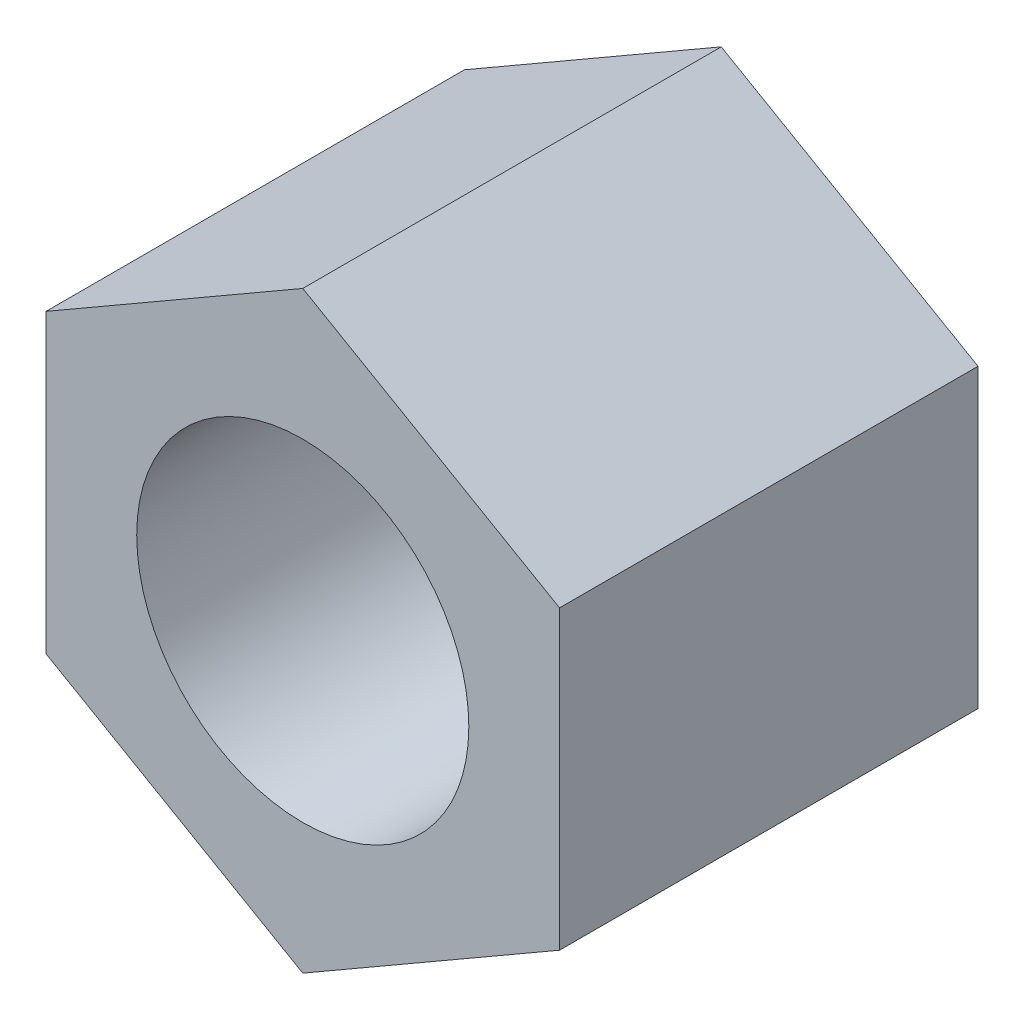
ISO-10303-21;
HEADER;
FILE_DESCRIPTION(('STEP AP214'),'2;1');
FILE_NAME('part.step','',(''),(''),'','','');
FILE_SCHEMA(('AUTOMOTIVE_DESIGN { 1 0 10303 214 1 1 1 1 }'));
ENDSEC;
DATA;
#1=APPLICATION_CONTEXT('core data for automotive mechanical design processes');
#2=APPLICATION_PROTOCOL_DEFINITION('international standard','automotive_design',2000,#1);
#3=PRODUCT_CONTEXT('',#1,'mechanical');
#4=PRODUCT('Part','Part','',(#3));
#5=PRODUCT_RELATED_PRODUCT_CATEGORY('part','',(#4));
#6=PRODUCT_DEFINITION_FORMATION('','',#4);
#7=PRODUCT_DEFINITION_CONTEXT('part definition',#1,'design');
#8=PRODUCT_DEFINITION('design','',#6,#7);
#9=PRODUCT_DEFINITION_SHAPE('','',#8);
#10=(LENGTH_UNIT() NAMED_UNIT(*) SI_UNIT(.MILLI.,.METRE.));
#11=(NAMED_UNIT(*) PLANE_ANGLE_UNIT() SI_UNIT($,.RADIAN.));
#12=(NAMED_UNIT(*) SI_UNIT($,.STERADIAN.) SOLID_ANGLE_UNIT());
#13=UNCERTAINTY_MEASURE_WITH_UNIT(LENGTH_MEASURE(1.E-05),#10,'distance_accuracy_value','');
#14=(GEOMETRIC_REPRESENTATION_CONTEXT(3) GLOBAL_UNCERTAINTY_ASSIGNED_CONTEXT((#13)) GLOBAL_UNIT_ASSIGNED_CONTEXT((#10,
#11,#12)) REPRESENTATION_CONTEXT('',''));
#15=CARTESIAN_POINT('',(0.,0.,0.));
#16=DIRECTION('',(0.,0.,1.));
#17=DIRECTION('',(1.,0.,0.));
#18=AXIS2_PLACEMENT_3D('',#15,#16,#17);
#19=CARTESIAN_POINT('',(0.,0.,56.007));
#20=DIRECTION('',(0.,0.,1.));
#21=DIRECTION('',(1.,0.,0.));
#22=AXIS2_PLACEMENT_3D('',#19,#20,#21);
#23=PLANE('',#22);
#24=DIRECTION('',(0.,1.,0.));
#25=VECTOR('',#24,1.);
#26=CARTESIAN_POINT('',(34.3662,-19.8413348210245,56.007));
#27=LINE('',#26,#25);
#28=CARTESIAN_POINT('',(34.3662,-19.8413348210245,56.007));
#29=VERTEX_POINT('',#28);
#30=CARTESIAN_POINT('',(34.3662,19.8413348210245,56.007));
#31=VERTEX_POINT('',#30);
#32=EDGE_CURVE('E139',#29,#31,#27,.T.);
#33=ORIENTED_EDGE('',*,*,#32,.T.);
#34=DIRECTION('',(-0.866025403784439,0.5,0.));
#35=VECTOR('',#34,1.);
#36=CARTESIAN_POINT('',(34.3662,19.8413348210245,56.007));
#37=LINE('',#36,#35);
#38=CARTESIAN_POINT('',(0.,39.682669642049,56.007));
#39=VERTEX_POINT('',#38);
#40=EDGE_CURVE('E100',#31,#39,#37,.T.);
#41=ORIENTED_EDGE('',*,*,#40,.T.);
#42=DIRECTION('',(-0.866025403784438,-0.5,0.));
#43=VECTOR('',#42,1.);
#44=CARTESIAN_POINT('',(0.,39.682669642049,56.007));
#45=LINE('',#44,#43);
#46=CARTESIAN_POINT('',(-34.3662,19.8413348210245,56.007));
#47=VERTEX_POINT('',#46);
#48=EDGE_CURVE('E109',#39,#47,#45,.T.);
#49=ORIENTED_EDGE('',*,*,#48,.T.);
#50=DIRECTION('',(0.,-1.,0.));
#51=VECTOR('',#50,1.);
#52=CARTESIAN_POINT('',(-34.3662,19.8413348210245,56.007));
#53=LINE('',#52,#51);
#54=CARTESIAN_POINT('',(-34.3662,-19.8413348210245,56.007));
#55=VERTEX_POINT('',#54);
#56=EDGE_CURVE('E102',#47,#55,#53,.T.);
#57=ORIENTED_EDGE('',*,*,#56,.T.);
#58=DIRECTION('',(0.866025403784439,-0.5,0.));
#59=VECTOR('',#58,1.);
#60=CARTESIAN_POINT('',(-34.3662,-19.8413348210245,56.007));
#61=LINE('',#60,#59);
#62=CARTESIAN_POINT('',(0.,-39.682669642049,56.007));
#63=VERTEX_POINT('',#62);
#64=EDGE_CURVE('E107',#55,#63,#61,.T.);
#65=ORIENTED_EDGE('',*,*,#64,.T.);
#66=DIRECTION('',(0.866025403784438,0.5,0.));
#67=VECTOR('',#66,1.);
#68=CARTESIAN_POINT('',(0.,-39.682669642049,56.007));
#69=LINE('',#68,#67);
#70=EDGE_CURVE('E58',#63,#29,#69,.T.);
#71=ORIENTED_EDGE('',*,*,#70,.T.);
#72=EDGE_LOOP('',(#33,#41,#49,#57,#65,#71));
#73=FACE_BOUND('',#72,.T.);
#74=CARTESIAN_POINT('',(0.,0.,56.007));
#75=DIRECTION('',(0.,0.,1.));
#76=DIRECTION('',(1.,0.,0.));
#77=AXIS2_PLACEMENT_3D('',#74,#75,#76);
#78=CIRCLE('',#77,22.225);
#79=CARTESIAN_POINT('',(22.225,0.,56.007));
#80=VERTEX_POINT('',#79);
#81=EDGE_CURVE('E135',#80,#80,#78,.T.);
#82=ORIENTED_EDGE('',*,*,#81,.F.);
#83=EDGE_LOOP('',(#82));
#84=FACE_BOUND('',#83,.T.);
#85=ADVANCED_FACE('F43',(#73,#84),#23,.T.);
#86=CARTESIAN_POINT('',(0.,0.,0.));
#87=DIRECTION('',(0.,0.,1.));
#88=DIRECTION('',(1.,0.,0.));
#89=AXIS2_PLACEMENT_3D('',#86,#87,#88);
#90=PLANE('',#89);
#91=DIRECTION('',(0.,1.,0.));
#92=VECTOR('',#91,1.);
#93=CARTESIAN_POINT('',(34.3662,-19.8413348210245,0.));
#94=LINE('',#93,#92);
#95=CARTESIAN_POINT('',(34.3662,-19.8413348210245,0.));
#96=VERTEX_POINT('',#95);
#97=CARTESIAN_POINT('',(34.3662,19.8413348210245,0.));
#98=VERTEX_POINT('',#97);
#99=EDGE_CURVE('E126',#96,#98,#94,.T.);
#100=ORIENTED_EDGE('',*,*,#99,.F.);
#101=DIRECTION('',(0.866025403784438,0.5,0.));
#102=VECTOR('',#101,1.);
#103=CARTESIAN_POINT('',(0.,-39.682669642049,0.));
#104=LINE('',#103,#102);
#105=CARTESIAN_POINT('',(0.,-39.682669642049,0.));
#106=VERTEX_POINT('',#105);
#107=EDGE_CURVE('E90',#106,#96,#104,.T.);
#108=ORIENTED_EDGE('',*,*,#107,.F.);
#109=DIRECTION('',(0.866025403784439,-0.5,0.));
#110=VECTOR('',#109,1.);
#111=CARTESIAN_POINT('',(-34.3662,-19.8413348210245,0.));
#112=LINE('',#111,#110);
#113=CARTESIAN_POINT('',(-34.3662,-19.8413348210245,0.));
#114=VERTEX_POINT('',#113);
#115=EDGE_CURVE('E81',#114,#106,#112,.T.);
#116=ORIENTED_EDGE('',*,*,#115,.F.);
#117=DIRECTION('',(0.,-1.,0.));
#118=VECTOR('',#117,1.);
#119=CARTESIAN_POINT('',(-34.3662,19.8413348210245,0.));
#120=LINE('',#119,#118);
#121=CARTESIAN_POINT('',(-34.3662,19.8413348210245,0.));
#122=VERTEX_POINT('',#121);
#123=EDGE_CURVE('E117',#122,#114,#120,.T.);
#124=ORIENTED_EDGE('',*,*,#123,.F.);
#125=DIRECTION('',(-0.866025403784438,-0.5,0.));
#126=VECTOR('',#125,1.);
#127=CARTESIAN_POINT('',(0.,39.682669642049,0.));
#128=LINE('',#127,#126);
#129=CARTESIAN_POINT('',(0.,39.682669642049,0.));
#130=VERTEX_POINT('',#129);
#131=EDGE_CURVE('E133',#130,#122,#128,.T.);
#132=ORIENTED_EDGE('',*,*,#131,.F.);
#133=DIRECTION('',(-0.866025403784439,0.5,0.));
#134=VECTOR('',#133,1.);
#135=CARTESIAN_POINT('',(34.3662,19.8413348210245,0.));
#136=LINE('',#135,#134);
#137=EDGE_CURVE('E131',#98,#130,#136,.T.);
#138=ORIENTED_EDGE('',*,*,#137,.F.);
#139=EDGE_LOOP('',(#100,#108,#116,#124,#132,#138));
#140=FACE_BOUND('',#139,.T.);
#141=CARTESIAN_POINT('',(0.,0.,0.));
#142=DIRECTION('',(0.,0.,1.));
#143=DIRECTION('',(1.,0.,0.));
#144=AXIS2_PLACEMENT_3D('',#141,#142,#143);
#145=CIRCLE('',#144,22.225);
#146=CARTESIAN_POINT('',(22.225,0.,0.));
#147=VERTEX_POINT('',#146);
#148=EDGE_CURVE('E235',#147,#147,#145,.T.);
#149=ORIENTED_EDGE('',*,*,#148,.T.);
#150=EDGE_LOOP('',(#149));
#151=FACE_BOUND('',#150,.T.);
#152=ADVANCED_FACE('F146',(#140,#151),#90,.F.);
#153=CARTESIAN_POINT('',(34.3662,-19.8413348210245,56.007));
#154=DIRECTION('',(-1.,0.,0.));
#155=DIRECTION('',(0.,0.,1.));
#156=AXIS2_PLACEMENT_3D('',#153,#154,#155);
#157=PLANE('',#156);
#158=ORIENTED_EDGE('',*,*,#99,.T.);
#159=DIRECTION('',(0.,0.,-1.));
#160=VECTOR('',#159,1.);
#161=CARTESIAN_POINT('',(34.3662,19.8413348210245,56.007));
#162=LINE('',#161,#160);
#163=EDGE_CURVE('E11',#31,#98,#162,.T.);
#164=ORIENTED_EDGE('',*,*,#163,.F.);
#165=ORIENTED_EDGE('',*,*,#32,.F.);
#166=DIRECTION('',(0.,0.,-1.));
#167=VECTOR('',#166,1.);
#168=CARTESIAN_POINT('',(34.3662,-19.8413348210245,56.007));
#169=LINE('',#168,#167);
#170=EDGE_CURVE('E124',#29,#96,#169,.T.);
#171=ORIENTED_EDGE('',*,*,#170,.T.);
#172=EDGE_LOOP('',(#158,#164,#165,#171));
#173=FACE_BOUND('',#172,.T.);
#174=ADVANCED_FACE('F44',(#173),#157,.F.);
#175=CARTESIAN_POINT('',(34.3662,19.8413348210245,56.007));
#176=DIRECTION('',(-0.5,-0.866025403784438,0.));
#177=DIRECTION('',(0.866025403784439,-0.5,0.));
#178=AXIS2_PLACEMENT_3D('',#175,#176,#177);
#179=PLANE('',#178);
#180=ORIENTED_EDGE('',*,*,#137,.T.);
#181=DIRECTION('',(0.,0.,-1.));
#182=VECTOR('',#181,1.);
#183=CARTESIAN_POINT('',(0.,39.682669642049,56.007));
#184=LINE('',#183,#182);
#185=EDGE_CURVE('E55',#39,#130,#184,.T.);
#186=ORIENTED_EDGE('',*,*,#185,.F.);
#187=ORIENTED_EDGE('',*,*,#40,.F.);
#188=ORIENTED_EDGE('',*,*,#163,.T.);
#189=EDGE_LOOP('',(#180,#186,#187,#188));
#190=FACE_BOUND('',#189,.T.);
#191=ADVANCED_FACE('F172',(#190),#179,.F.);
#192=CARTESIAN_POINT('',(0.,39.682669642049,56.007));
#193=DIRECTION('',(0.5,-0.866025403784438,0.));
#194=DIRECTION('',(0.866025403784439,0.5,0.));
#195=AXIS2_PLACEMENT_3D('',#192,#193,#194);
#196=PLANE('',#195);
#197=ORIENTED_EDGE('',*,*,#131,.T.);
#198=DIRECTION('',(0.,0.,-1.));
#199=VECTOR('',#198,1.);
#200=CARTESIAN_POINT('',(-34.3662,19.8413348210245,56.007));
#201=LINE('',#200,#199);
#202=EDGE_CURVE('E118',#47,#122,#201,.T.);
#203=ORIENTED_EDGE('',*,*,#202,.F.);
#204=ORIENTED_EDGE('',*,*,#48,.F.);
#205=ORIENTED_EDGE('',*,*,#185,.T.);
#206=EDGE_LOOP('',(#197,#203,#204,#205));
#207=FACE_BOUND('',#206,.T.);
#208=ADVANCED_FACE('F144',(#207),#196,.F.);
#209=CARTESIAN_POINT('',(-34.3662,19.8413348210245,56.007));
#210=DIRECTION('',(1.,0.,0.));
#211=DIRECTION('',(0.,0.,-1.));
#212=AXIS2_PLACEMENT_3D('',#209,#210,#211);
#213=PLANE('',#212);
#214=ORIENTED_EDGE('',*,*,#123,.T.);
#215=DIRECTION('',(0.,0.,-1.));
#216=VECTOR('',#215,1.);
#217=CARTESIAN_POINT('',(-34.3662,-19.8413348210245,56.007));
#218=LINE('',#217,#216);
#219=EDGE_CURVE('E113',#55,#114,#218,.T.);
#220=ORIENTED_EDGE('',*,*,#219,.F.);
#221=ORIENTED_EDGE('',*,*,#56,.F.);
#222=ORIENTED_EDGE('',*,*,#202,.T.);
#223=EDGE_LOOP('',(#214,#220,#221,#222));
#224=FACE_BOUND('',#223,.T.);
#225=ADVANCED_FACE('F116',(#224),#213,.F.);
#226=CARTESIAN_POINT('',(-34.3662,-19.8413348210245,56.007));
#227=DIRECTION('',(0.5,0.866025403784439,0.));
#228=DIRECTION('',(-0.866025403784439,0.5,0.));
#229=AXIS2_PLACEMENT_3D('',#226,#227,#228);
#230=PLANE('',#229);
#231=ORIENTED_EDGE('',*,*,#115,.T.);
#232=DIRECTION('',(0.,0.,-1.));
#233=VECTOR('',#232,1.);
#234=CARTESIAN_POINT('',(0.,-39.682669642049,56.007));
#235=LINE('',#234,#233);
#236=EDGE_CURVE('E119',#63,#106,#235,.T.);
#237=ORIENTED_EDGE('',*,*,#236,.F.);
#238=ORIENTED_EDGE('',*,*,#64,.F.);
#239=ORIENTED_EDGE('',*,*,#219,.T.);
#240=EDGE_LOOP('',(#231,#237,#238,#239));
#241=FACE_BOUND('',#240,.T.);
#242=ADVANCED_FACE('F125',(#241),#230,.F.);
#243=CARTESIAN_POINT('',(0.,-39.682669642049,56.007));
#244=DIRECTION('',(-0.5,0.866025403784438,0.));
#245=DIRECTION('',(-0.866025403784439,-0.5,0.));
#246=AXIS2_PLACEMENT_3D('',#243,#244,#245);
#247=PLANE('',#246);
#248=ORIENTED_EDGE('',*,*,#107,.T.);
#249=ORIENTED_EDGE('',*,*,#170,.F.);
#250=ORIENTED_EDGE('',*,*,#70,.F.);
#251=ORIENTED_EDGE('',*,*,#236,.T.);
#252=EDGE_LOOP('',(#248,#249,#250,#251));
#253=FACE_BOUND('',#252,.T.);
#254=ADVANCED_FACE('F153',(#253),#247,.F.);
#255=CARTESIAN_POINT('',(0.,0.,56.007));
#256=DIRECTION('',(0.,0.,-1.));
#257=DIRECTION('',(-1.,0.,0.));
#258=AXIS2_PLACEMENT_3D('',#255,#256,#257);
#259=CYLINDRICAL_SURFACE('',#258,22.225);
#260=ORIENTED_EDGE('',*,*,#81,.T.);
#261=EDGE_LOOP('',(#260));
#262=FACE_BOUND('',#261,.T.);
#263=ORIENTED_EDGE('',*,*,#148,.F.);
#264=EDGE_LOOP('',(#263));
#265=FACE_BOUND('',#264,.T.);
#266=ADVANCED_FACE('F154',(#262,#265),#259,.F.);
#267=CLOSED_SHELL('',(#85,#152,#174,#191,#208,#225,#242,#254,#266));
#268=MANIFOLD_SOLID_BREP('B2',#267);
#269=ADVANCED_BREP_SHAPE_REPRESENTATION('',(#18,#268),#14);
#270=SHAPE_DEFINITION_REPRESENTATION(#9,#269);
ENDSEC;
END-ISO-10303-21;
